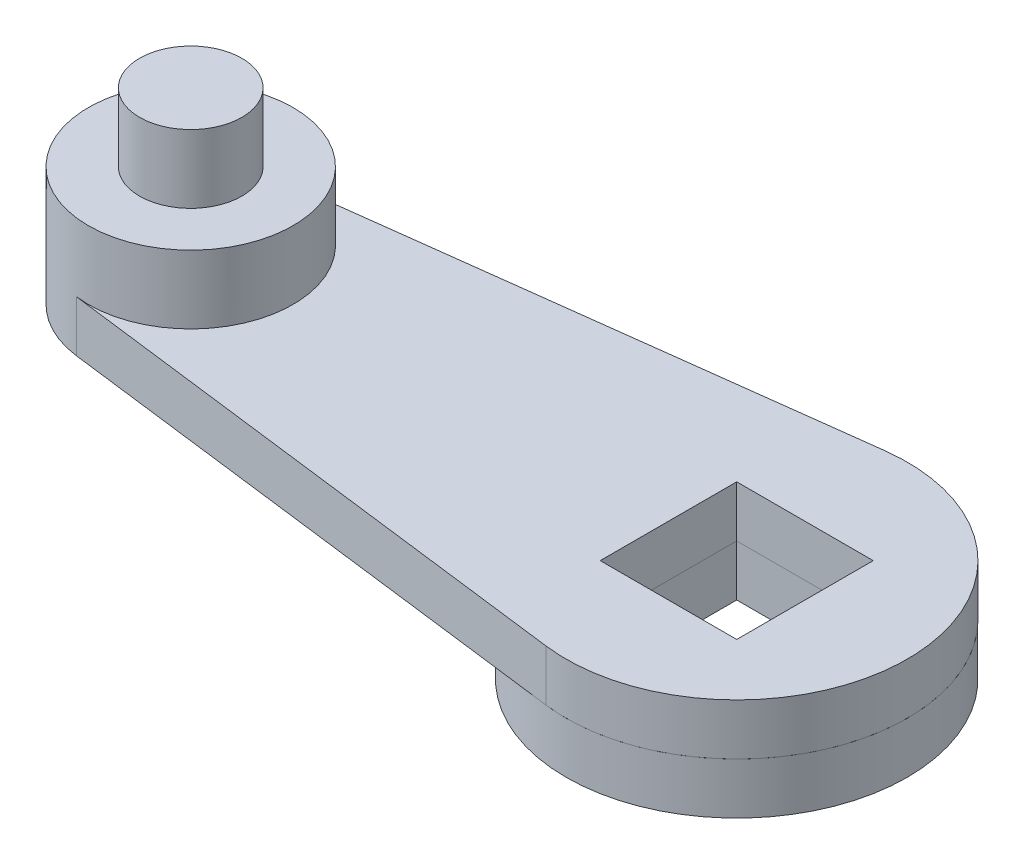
from build123d import *

# Parameters (mm, degrees)
SKETCH2_R      = 30
EXTRUDE1_DEPTH = 35
SKETCH2_3_R    = 50
SKETCH2_3_W    = 40
SKETCH2_3_H    = 40
EXTRUDE2_DEPTH = 15
SKETCH2_4_R    = 50
SKETCH2_4_W    = 40
SKETCH2_4_H    = 40
EXTRUDE3_DEPTH = 15
SKETCH3_R      = 15
EXTRUDE4_DEPTH = 20


with BuildPart() as part:
    # Sketch2 → Extrude1 (new body)
    with BuildSketch(Plane(origin=(0, 0, 0), x_dir=(1, 0, 0), z_dir=(0, 1, 0))):
        with Locations(Location((0, 0, 0), (0, 0, 270))):
            Circle(SKETCH2_R)
    extrude(amount=EXTRUDE1_DEPTH)

    # Sketch2_4 → Extrude3 (add)
    # profile 1 of 2: a face of its own
    with BuildSketch(Plane(origin=(0, 0, 0), x_dir=(1, 0, 0), z_dir=(0, 1, 0))):
        with BuildLine():
            Line((153.75, 49.607837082), (-3.75, 29.764702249))
            ThreePointArc((-3.75, 29.764702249), (19.843134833, 22.5), (30, 0))
            ThreePointArc((30, 0), (19.843134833, -22.5), (-3.75, -29.764702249))
            Line((-3.75, -29.764702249), (153.75, -49.607837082))
            ThreePointArc((153.75, -49.607837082), (110, 0), (153.75, 49.607837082))
        make_face()
    # profile 2 of 2: a face of its own
    with BuildSketch(Plane(origin=(0, 0, 0), x_dir=(1, 0, 0), z_dir=(0, 1, 0))):
        with Locations(Location((160, 0, 0), (0, 0, 270))):
            Circle(SKETCH2_4_R)
        with Locations((160, 0)):
            Rectangle(SKETCH2_4_W, SKETCH2_4_H, mode=Mode.SUBTRACT)
    extrude(amount=EXTRUDE3_DEPTH)

    # Sketch3 → Extrude4 (add)
    with BuildSketch(Plane(origin=(0, 35, 0), x_dir=(-1, 0, 0), z_dir=(0, 1, 0))):
        with Locations(Location((0, 0, 0), (0, 0, 90))):
            Circle(SKETCH3_R)
    extrude(amount=EXTRUDE4_DEPTH)


with BuildPart() as body_2:
    # Sketch2_3 → Extrude2 (new body)
    with BuildSketch(Plane(origin=(0, 0, 0), x_dir=(1, 0, 0), z_dir=(0, 1, 0))):
        with Locations(Location((160, 0, 0), (0, 0, 270))):
            Circle(SKETCH2_3_R)
        with Locations((160, 0)):
            Rectangle(SKETCH2_3_W, SKETCH2_3_H, mode=Mode.SUBTRACT)
    extrude(amount=-EXTRUDE2_DEPTH)


solid = Compound([part.part, body_2.part])
